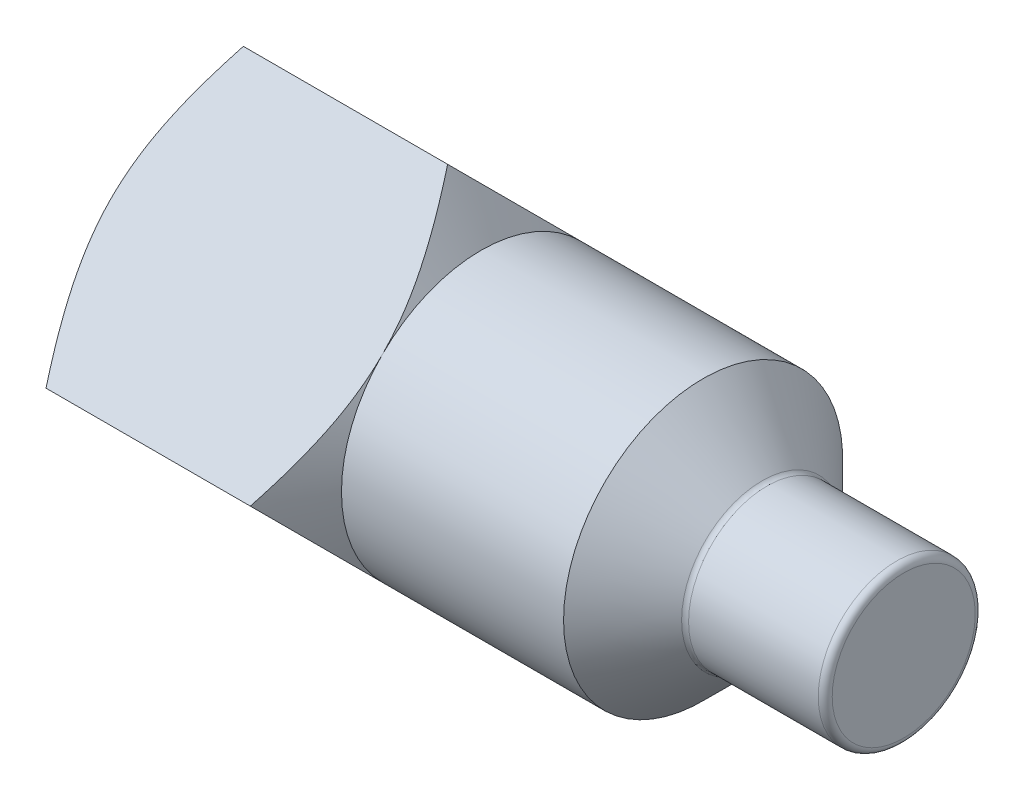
from build123d import *

# Parameters (mm, degrees)
BASEHEAD_DEPTH = 4
FILLET1_R      = 0.1


with BuildPart() as part:
    # BaseHeadSke → BaseHead (new body)
    with BuildSketch(Plane(origin=(0, 0, 0), x_dir=(0, 0, -1), z_dir=(1, 0, 0))):
        Polygon((0, 2.828427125), (2.828427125, 0), (0, -2.828427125), (-2.828427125, 0), align=None)
    extrude(amount=BASEHEAD_DEPTH)

    # HeadChamferSke → HeadChamfer (revolve, cut)
    with BuildSketch(Plane.XY, mode=Mode.PRIVATE) as headchamfer_sk:
        Polygon((0, 2.828427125), (0, 1.9), (0.53602765, 2.828427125), align=None)
        Polygon((3.46397235, 2.828427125), (4, 1.9), (4, 2.828427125), align=None)
    revolve(headchamfer_sk.sketch.rotate(Axis((0, 0, 0), (1, 0, 0)), 270), axis=Axis((0, 0, 0), (1, 0, 0)), mode=Mode.SUBTRACT)

    # BodySke → BaseBody (revolve)
    with BuildSketch(Plane.XY, mode=Mode.PRIVATE) as basebody_sk:
        Polygon((3.46397235, 2), (3.46397235, 0), (10, 0), (10, 1.125), (8, 1.125), (8, 2), align=None)
    revolve(basebody_sk.sketch.rotate(Axis((0, 0, 0), (1, 0, 0)), 90), axis=Axis((0, 0, 0), (1, 0, 0)))

    # ChamferEndSke → ChamferEnd (revolve, cut)
    with BuildSketch(Plane.XY, mode=Mode.PRIVATE) as chamferend_sk:
        Polygon((8, 2), (8, 1.125), (7.125, 2), align=None)
    revolve(chamferend_sk.sketch.rotate(Axis((0, 0, 0), (1, 0, 0)), 90), axis=Axis((0, 0, 0), (1, 0, 0)), mode=Mode.SUBTRACT)

    # Fillet1
    fillet1_edges = [part.edges().sort_by_distance(p)[0] for p in [
        (10, 0, -1.125),
        (8, 0, -1.125),
    ]]
    fillet(fillet1_edges, radius=FILLET1_R)


solid = part.part
